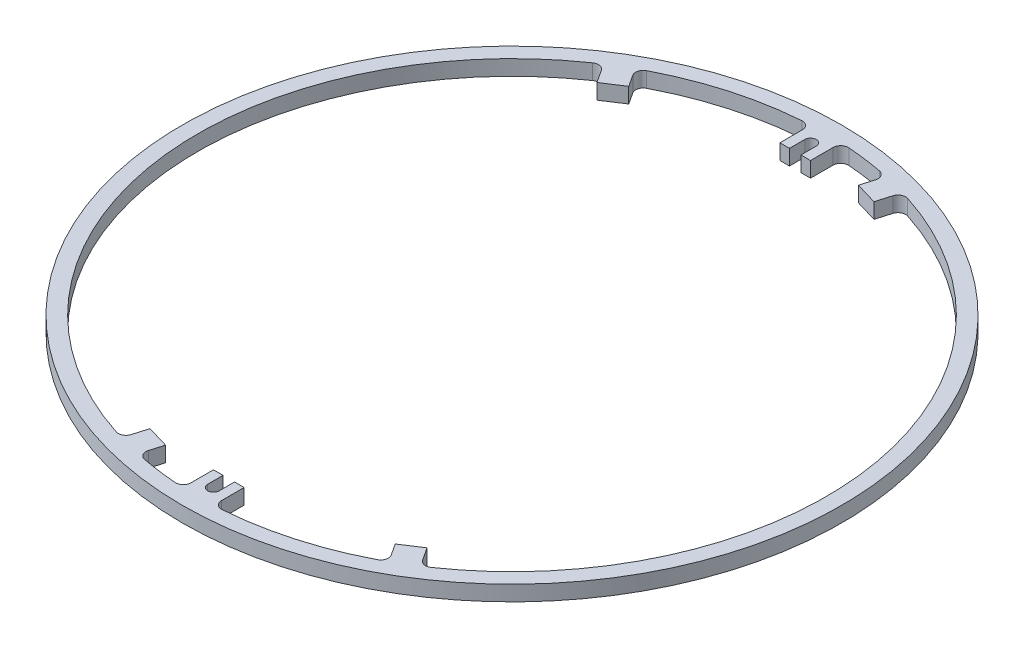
ISO-10303-21;
HEADER;
FILE_DESCRIPTION(('STEP AP214'),'2;1');
FILE_NAME('part.step','',(''),(''),'','','');
FILE_SCHEMA(('AUTOMOTIVE_DESIGN { 1 0 10303 214 1 1 1 1 }'));
ENDSEC;
DATA;
#1=APPLICATION_CONTEXT('core data for automotive mechanical design processes');
#2=APPLICATION_PROTOCOL_DEFINITION('international standard','automotive_design',2000,#1);
#3=PRODUCT_CONTEXT('',#1,'mechanical');
#4=PRODUCT('Part','Part','',(#3));
#5=PRODUCT_RELATED_PRODUCT_CATEGORY('part','',(#4));
#6=PRODUCT_DEFINITION_FORMATION('','',#4);
#7=PRODUCT_DEFINITION_CONTEXT('part definition',#1,'design');
#8=PRODUCT_DEFINITION('design','',#6,#7);
#9=PRODUCT_DEFINITION_SHAPE('','',#8);
#10=(LENGTH_UNIT() NAMED_UNIT(*) SI_UNIT(.MILLI.,.METRE.));
#11=(NAMED_UNIT(*) PLANE_ANGLE_UNIT() SI_UNIT($,.RADIAN.));
#12=(NAMED_UNIT(*) SI_UNIT($,.STERADIAN.) SOLID_ANGLE_UNIT());
#13=UNCERTAINTY_MEASURE_WITH_UNIT(LENGTH_MEASURE(1.E-05),#10,'distance_accuracy_value','');
#14=(GEOMETRIC_REPRESENTATION_CONTEXT(3) GLOBAL_UNCERTAINTY_ASSIGNED_CONTEXT((#13)) GLOBAL_UNIT_ASSIGNED_CONTEXT((#10,
#11,#12)) REPRESENTATION_CONTEXT('',''));
#15=CARTESIAN_POINT('',(0.,0.,0.));
#16=DIRECTION('',(0.,0.,1.));
#17=DIRECTION('',(1.,0.,0.));
#18=AXIS2_PLACEMENT_3D('',#15,#16,#17);
#19=CARTESIAN_POINT('',(0.,2.,0.));
#20=DIRECTION('',(0.,-1.,0.));
#21=DIRECTION('',(0.,0.,-1.));
#22=AXIS2_PLACEMENT_3D('',#19,#20,#21);
#23=CYLINDRICAL_SURFACE('',#22,41.);
#24=CARTESIAN_POINT('',(0.,2.,0.));
#25=DIRECTION('',(0.,1.,0.));
#26=DIRECTION('',(0.,0.,1.));
#27=AXIS2_PLACEMENT_3D('',#24,#25,#26);
#28=CIRCLE('',#27,41.);
#29=CARTESIAN_POINT('',(-3.075,2.,-40.8845248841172));
#30=VERTEX_POINT('',#29);
#31=CARTESIAN_POINT('',(-18.8433014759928,2.,-36.4133215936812));
#32=VERTEX_POINT('',#31);
#33=EDGE_CURVE('E505',#30,#32,#28,.T.);
#34=ORIENTED_EDGE('',*,*,#33,.T.);
#35=DIRECTION('',(0.,-1.,0.));
#36=VECTOR('',#35,1.);
#37=CARTESIAN_POINT('',(-18.8433014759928,2.,-36.4133215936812));
#38=LINE('',#37,#36);
#39=CARTESIAN_POINT('',(-18.8433014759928,0.,-36.4133215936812));
#40=VERTEX_POINT('',#39);
#41=EDGE_CURVE('E611',#32,#40,#38,.T.);
#42=ORIENTED_EDGE('',*,*,#41,.T.);
#43=CARTESIAN_POINT('',(0.,0.,0.));
#44=DIRECTION('',(0.,1.,0.));
#45=DIRECTION('',(0.,0.,1.));
#46=AXIS2_PLACEMENT_3D('',#43,#44,#45);
#47=CIRCLE('',#46,41.);
#48=CARTESIAN_POINT('',(-3.075,0.,-40.8845248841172));
#49=VERTEX_POINT('',#48);
#50=EDGE_CURVE('E510',#49,#40,#47,.T.);
#51=ORIENTED_EDGE('',*,*,#50,.F.);
#52=DIRECTION('',(0.,-1.,0.));
#53=VECTOR('',#52,1.);
#54=CARTESIAN_POINT('',(-3.075,2.,-40.8845248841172));
#55=LINE('',#54,#53);
#56=EDGE_CURVE('E522',#49,#30,#55,.F.);
#57=ORIENTED_EDGE('',*,*,#56,.T.);
#58=EDGE_LOOP('',(#34,#42,#51,#57));
#59=FACE_BOUND('',#58,.T.);
#60=ADVANCED_FACE('F37',(#59),#23,.F.);
#61=CARTESIAN_POINT('',(3.075,2.,40.8845248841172));
#62=VERTEX_POINT('',#61);
#63=CARTESIAN_POINT('',(18.8433014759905,2.,36.4133215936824));
#64=VERTEX_POINT('',#63);
#65=EDGE_CURVE('E500',#62,#64,#28,.T.);
#66=ORIENTED_EDGE('',*,*,#65,.T.);
#67=DIRECTION('',(0.,-1.,0.));
#68=VECTOR('',#67,1.);
#69=CARTESIAN_POINT('',(18.8433014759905,2.,36.4133215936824));
#70=LINE('',#69,#68);
#71=CARTESIAN_POINT('',(18.8433014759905,0.,36.4133215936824));
#72=VERTEX_POINT('',#71);
#73=EDGE_CURVE('E620',#64,#72,#70,.T.);
#74=ORIENTED_EDGE('',*,*,#73,.T.);
#75=CARTESIAN_POINT('',(3.075,0.,40.8845248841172));
#76=VERTEX_POINT('',#75);
#77=EDGE_CURVE('E506',#76,#72,#47,.T.);
#78=ORIENTED_EDGE('',*,*,#77,.F.);
#79=DIRECTION('',(0.,-1.,0.));
#80=VECTOR('',#79,1.);
#81=CARTESIAN_POINT('',(3.075,2.,40.8845248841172));
#82=LINE('',#81,#80);
#83=EDGE_CURVE('E536',#76,#62,#82,.F.);
#84=ORIENTED_EDGE('',*,*,#83,.T.);
#85=EDGE_LOOP('',(#66,#74,#78,#84));
#86=FACE_BOUND('',#85,.T.);
#87=ADVANCED_FACE('F703',(#86),#23,.F.);
#88=CARTESIAN_POINT('',(23.2418440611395,0.,33.7759779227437));
#89=VERTEX_POINT('',#88);
#90=CARTESIAN_POINT('',(12.6237798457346,0.,-39.0082066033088));
#91=VERTEX_POINT('',#90);
#92=EDGE_CURVE('E509',#89,#91,#47,.T.);
#93=ORIENTED_EDGE('',*,*,#92,.F.);
#94=DIRECTION('',(0.,-1.,0.));
#95=VECTOR('',#94,1.);
#96=CARTESIAN_POINT('',(23.2418440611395,2.,33.7759779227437));
#97=LINE('',#96,#95);
#98=CARTESIAN_POINT('',(23.2418440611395,2.,33.7759779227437));
#99=VERTEX_POINT('',#98);
#100=EDGE_CURVE('E618',#89,#99,#97,.F.);
#101=ORIENTED_EDGE('',*,*,#100,.T.);
#102=CARTESIAN_POINT('',(12.6237798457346,2.,-39.0082066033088));
#103=VERTEX_POINT('',#102);
#104=EDGE_CURVE('E504',#99,#103,#28,.T.);
#105=ORIENTED_EDGE('',*,*,#104,.T.);
#106=DIRECTION('',(0.,-1.,0.));
#107=VECTOR('',#106,1.);
#108=CARTESIAN_POINT('',(12.6237798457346,2.,-39.0082066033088));
#109=LINE('',#108,#107);
#110=EDGE_CURVE('E589',#103,#91,#109,.T.);
#111=ORIENTED_EDGE('',*,*,#110,.T.);
#112=EDGE_LOOP('',(#93,#101,#105,#111));
#113=FACE_BOUND('',#112,.T.);
#114=ADVANCED_FACE('F649',(#113),#23,.F.);
#115=CARTESIAN_POINT('',(-23.2418440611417,0.,-33.7759779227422));
#116=VERTEX_POINT('',#115);
#117=CARTESIAN_POINT('',(-12.6237798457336,0.,39.0082066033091));
#118=VERTEX_POINT('',#117);
#119=EDGE_CURVE('E653',#116,#118,#47,.T.);
#120=ORIENTED_EDGE('',*,*,#119,.F.);
#121=DIRECTION('',(0.,-1.,0.));
#122=VECTOR('',#121,1.);
#123=CARTESIAN_POINT('',(-23.2418440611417,2.,-33.7759779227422));
#124=LINE('',#123,#122);
#125=CARTESIAN_POINT('',(-23.2418440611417,2.,-33.7759779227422));
#126=VERTEX_POINT('',#125);
#127=EDGE_CURVE('E609',#116,#126,#124,.F.);
#128=ORIENTED_EDGE('',*,*,#127,.T.);
#129=CARTESIAN_POINT('',(-12.6237798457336,2.,39.0082066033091));
#130=VERTEX_POINT('',#129);
#131=EDGE_CURVE('E755',#126,#130,#28,.T.);
#132=ORIENTED_EDGE('',*,*,#131,.T.);
#133=DIRECTION('',(0.,-1.,0.));
#134=VECTOR('',#133,1.);
#135=CARTESIAN_POINT('',(-12.6237798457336,2.,39.0082066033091));
#136=LINE('',#135,#134);
#137=EDGE_CURVE('E574',#130,#118,#136,.T.);
#138=ORIENTED_EDGE('',*,*,#137,.T.);
#139=EDGE_LOOP('',(#120,#128,#132,#138));
#140=FACE_BOUND('',#139,.T.);
#141=ADVANCED_FACE('F731',(#140),#23,.F.);
#142=CARTESIAN_POINT('',(0.,-5.69147245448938,36.9511904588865));
#143=DIRECTION('',(0.,0.,1.));
#144=DIRECTION('',(1.,0.,0.));
#145=AXIS2_PLACEMENT_3D('',#142,#143,#144);
#146=PLANE('',#145);
#147=DIRECTION('',(1.,0.,0.));
#148=VECTOR('',#147,1.);
#149=CARTESIAN_POINT('',(0.,2.,36.9511904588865));
#150=LINE('',#149,#148);
#151=CARTESIAN_POINT('',(-2.,2.,36.9511904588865));
#152=VERTEX_POINT('',#151);
#153=CARTESIAN_POINT('',(-0.75,2.,36.9511904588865));
#154=VERTEX_POINT('',#153);
#155=EDGE_CURVE('E484',#152,#154,#150,.T.);
#156=ORIENTED_EDGE('',*,*,#155,.T.);
#157=DIRECTION('',(0.,-1.,0.));
#158=VECTOR('',#157,1.);
#159=CARTESIAN_POINT('',(-0.75,-5.69147245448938,36.9511904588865));
#160=LINE('',#159,#158);
#161=CARTESIAN_POINT('',(-0.75,0.,36.9511904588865));
#162=VERTEX_POINT('',#161);
#163=EDGE_CURVE('E563',#154,#162,#160,.T.);
#164=ORIENTED_EDGE('',*,*,#163,.T.);
#165=DIRECTION('',(-1.,0.,0.));
#166=VECTOR('',#165,1.);
#167=CARTESIAN_POINT('',(0.,0.,36.9511904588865));
#168=LINE('',#167,#166);
#169=CARTESIAN_POINT('',(-2.,0.,36.9511904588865));
#170=VERTEX_POINT('',#169);
#171=EDGE_CURVE('E478',#162,#170,#168,.T.);
#172=ORIENTED_EDGE('',*,*,#171,.T.);
#173=DIRECTION('',(0.,1.,0.));
#174=VECTOR('',#173,1.);
#175=CARTESIAN_POINT('',(-2.,-5.69147245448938,36.9511904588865));
#176=LINE('',#175,#174);
#177=EDGE_CURVE('E492',#170,#152,#176,.T.);
#178=ORIENTED_EDGE('',*,*,#177,.T.);
#179=EDGE_LOOP('',(#156,#164,#172,#178));
#180=FACE_BOUND('',#179,.T.);
#181=ADVANCED_FACE('F676',(#180),#146,.F.);
#182=CARTESIAN_POINT('',(0.,-5.69147245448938,-38.9511904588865));
#183=DIRECTION('',(0.,1.,0.));
#184=DIRECTION('',(0.,0.,1.));
#185=AXIS2_PLACEMENT_3D('',#182,#183,#184);
#186=CYLINDRICAL_SURFACE('',#185,0.750000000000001);
#187=DIRECTION('',(0.,1.,0.));
#188=VECTOR('',#187,1.);
#189=CARTESIAN_POINT('',(0.75,0.,-38.9511904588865));
#190=LINE('',#189,#188);
#191=CARTESIAN_POINT('',(0.75,0.,-38.9511904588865));
#192=VERTEX_POINT('',#191);
#193=CARTESIAN_POINT('',(0.75,2.,-38.9511904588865));
#194=VERTEX_POINT('',#193);
#195=EDGE_CURVE('E420',#192,#194,#190,.T.);
#196=ORIENTED_EDGE('',*,*,#195,.T.);
#197=CARTESIAN_POINT('',(0.,2.,-38.9511904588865));
#198=DIRECTION('',(0.,1.,0.));
#199=DIRECTION('',(0.,0.,1.));
#200=AXIS2_PLACEMENT_3D('',#197,#198,#199);
#201=CIRCLE('',#200,0.750000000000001);
#202=CARTESIAN_POINT('',(-0.75,2.,-38.9511904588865));
#203=VERTEX_POINT('',#202);
#204=EDGE_CURVE('E423',#194,#203,#201,.T.);
#205=ORIENTED_EDGE('',*,*,#204,.T.);
#206=DIRECTION('',(0.,1.,0.));
#207=VECTOR('',#206,1.);
#208=CARTESIAN_POINT('',(-0.75,0.,-38.9511904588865));
#209=LINE('',#208,#207);
#210=CARTESIAN_POINT('',(-0.75,0.,-38.9511904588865));
#211=VERTEX_POINT('',#210);
#212=EDGE_CURVE('E415',#211,#203,#209,.T.);
#213=ORIENTED_EDGE('',*,*,#212,.F.);
#214=CARTESIAN_POINT('',(0.,0.,-38.9511904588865));
#215=DIRECTION('',(0.,1.,0.));
#216=DIRECTION('',(0.,0.,1.));
#217=AXIS2_PLACEMENT_3D('',#214,#215,#216);
#218=CIRCLE('',#217,0.750000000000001);
#219=EDGE_CURVE('E455',#211,#192,#218,.F.);
#220=ORIENTED_EDGE('',*,*,#219,.T.);
#221=EDGE_LOOP('',(#196,#205,#213,#220));
#222=FACE_BOUND('',#221,.T.);
#223=ADVANCED_FACE('F735',(#222),#186,.F.);
#224=CARTESIAN_POINT('',(0.,-5.69147245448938,-36.9511904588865));
#225=DIRECTION('',(0.,0.,1.));
#226=DIRECTION('',(1.,0.,0.));
#227=AXIS2_PLACEMENT_3D('',#224,#225,#226);
#228=PLANE('',#227);
#229=DIRECTION('',(0.,1.,0.));
#230=VECTOR('',#229,1.);
#231=CARTESIAN_POINT('',(0.75,-5.69147245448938,-36.9511904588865));
#232=LINE('',#231,#230);
#233=CARTESIAN_POINT('',(0.75,0.,-36.9511904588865));
#234=VERTEX_POINT('',#233);
#235=CARTESIAN_POINT('',(0.75,2.,-36.9511904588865));
#236=VERTEX_POINT('',#235);
#237=EDGE_CURVE('E558',#234,#236,#232,.T.);
#238=ORIENTED_EDGE('',*,*,#237,.F.);
#239=DIRECTION('',(-1.,0.,0.));
#240=VECTOR('',#239,1.);
#241=CARTESIAN_POINT('',(0.,0.,-36.9511904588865));
#242=LINE('',#241,#240);
#243=CARTESIAN_POINT('',(2.,0.,-36.9511904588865));
#244=VERTEX_POINT('',#243);
#245=EDGE_CURVE('E449',#244,#234,#242,.T.);
#246=ORIENTED_EDGE('',*,*,#245,.F.);
#247=DIRECTION('',(0.,1.,0.));
#248=VECTOR('',#247,1.);
#249=CARTESIAN_POINT('',(2.,-5.69147245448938,-36.9511904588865));
#250=LINE('',#249,#248);
#251=CARTESIAN_POINT('',(2.,2.,-36.9511904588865));
#252=VERTEX_POINT('',#251);
#253=EDGE_CURVE('E448',#244,#252,#250,.T.);
#254=ORIENTED_EDGE('',*,*,#253,.T.);
#255=DIRECTION('',(1.,0.,0.));
#256=VECTOR('',#255,1.);
#257=CARTESIAN_POINT('',(0.,2.,-36.9511904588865));
#258=LINE('',#257,#256);
#259=EDGE_CURVE('E466',#236,#252,#258,.T.);
#260=ORIENTED_EDGE('',*,*,#259,.F.);
#261=EDGE_LOOP('',(#238,#246,#254,#260));
#262=FACE_BOUND('',#261,.T.);
#263=ADVANCED_FACE('F729',(#262),#228,.T.);
#264=CARTESIAN_POINT('',(7.65509878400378,0.,-40.2790201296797));
#265=VERTEX_POINT('',#264);
#266=CARTESIAN_POINT('',(3.075,0.,-40.8845248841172));
#267=VERTEX_POINT('',#266);
#268=EDGE_CURVE('E652',#265,#267,#47,.T.);
#269=ORIENTED_EDGE('',*,*,#268,.F.);
#270=DIRECTION('',(0.,-1.,0.));
#271=VECTOR('',#270,1.);
#272=CARTESIAN_POINT('',(7.65509878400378,2.,-40.2790201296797));
#273=LINE('',#272,#271);
#274=CARTESIAN_POINT('',(7.65509878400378,2.,-40.2790201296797));
#275=VERTEX_POINT('',#274);
#276=EDGE_CURVE('E592',#265,#275,#273,.F.);
#277=ORIENTED_EDGE('',*,*,#276,.T.);
#278=CARTESIAN_POINT('',(3.075,2.,-40.8845248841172));
#279=VERTEX_POINT('',#278);
#280=EDGE_CURVE('E770',#275,#279,#28,.T.);
#281=ORIENTED_EDGE('',*,*,#280,.T.);
#282=DIRECTION('',(0.,-1.,0.));
#283=VECTOR('',#282,1.);
#284=CARTESIAN_POINT('',(3.075,2.,-40.8845248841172));
#285=LINE('',#284,#283);
#286=EDGE_CURVE('E519',#279,#267,#285,.T.);
#287=ORIENTED_EDGE('',*,*,#286,.T.);
#288=EDGE_LOOP('',(#269,#277,#281,#287));
#289=FACE_BOUND('',#288,.T.);
#290=ADVANCED_FACE('F723',(#289),#23,.F.);
#291=CARTESIAN_POINT('',(-7.65509878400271,0.,40.2790201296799));
#292=VERTEX_POINT('',#291);
#293=CARTESIAN_POINT('',(-3.075,0.,40.8845248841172));
#294=VERTEX_POINT('',#293);
#295=EDGE_CURVE('E483',#292,#294,#47,.T.);
#296=ORIENTED_EDGE('',*,*,#295,.F.);
#297=DIRECTION('',(0.,-1.,0.));
#298=VECTOR('',#297,1.);
#299=CARTESIAN_POINT('',(-7.65509878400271,2.,40.2790201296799));
#300=LINE('',#299,#298);
#301=CARTESIAN_POINT('',(-7.65509878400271,2.,40.2790201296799));
#302=VERTEX_POINT('',#301);
#303=EDGE_CURVE('E566',#292,#302,#300,.F.);
#304=ORIENTED_EDGE('',*,*,#303,.T.);
#305=CARTESIAN_POINT('',(-3.075,2.,40.8845248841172));
#306=VERTEX_POINT('',#305);
#307=EDGE_CURVE('E508',#302,#306,#28,.T.);
#308=ORIENTED_EDGE('',*,*,#307,.T.);
#309=DIRECTION('',(0.,-1.,0.));
#310=VECTOR('',#309,1.);
#311=CARTESIAN_POINT('',(-3.075,2.,40.8845248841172));
#312=LINE('',#311,#310);
#313=EDGE_CURVE('E544',#306,#294,#312,.T.);
#314=ORIENTED_EDGE('',*,*,#313,.T.);
#315=EDGE_LOOP('',(#296,#304,#308,#314));
#316=FACE_BOUND('',#315,.T.);
#317=ADVANCED_FACE('F663',(#316),#23,.F.);
#318=CARTESIAN_POINT('',(0.,2.,0.));
#319=DIRECTION('',(0.,1.,0.));
#320=DIRECTION('',(0.,0.,1.));
#321=AXIS2_PLACEMENT_3D('',#318,#319,#320);
#322=PLANE('',#321);
#323=DIRECTION('',(0.,0.,-1.));
#324=VECTOR('',#323,1.);
#325=CARTESIAN_POINT('',(0.75,2.,-35.9511904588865));
#326=LINE('',#325,#324);
#327=EDGE_CURVE('E412',#236,#194,#326,.T.);
#328=ORIENTED_EDGE('',*,*,#327,.F.);
#329=ORIENTED_EDGE('',*,*,#259,.T.);
#330=DIRECTION('',(0.,0.,1.));
#331=VECTOR('',#330,1.);
#332=CARTESIAN_POINT('',(1.99999999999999,2.,0.));
#333=LINE('',#332,#331);
#334=CARTESIAN_POINT('',(2.,2.,-39.8873413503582));
#335=VERTEX_POINT('',#334);
#336=EDGE_CURVE('E461',#335,#252,#333,.T.);
#337=ORIENTED_EDGE('',*,*,#336,.F.);
#338=CARTESIAN_POINT('',(3.,2.,-39.8873413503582));
#339=DIRECTION('',(0.,1.,0.));
#340=DIRECTION('',(0.,0.,1.));
#341=AXIS2_PLACEMENT_3D('',#338,#339,#340);
#342=CIRCLE('',#341,1.);
#343=EDGE_CURVE('E527',#335,#279,#342,.F.);
#344=ORIENTED_EDGE('',*,*,#343,.T.);
#345=ORIENTED_EDGE('',*,*,#280,.F.);
#346=CARTESIAN_POINT('',(7.46838905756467,2.,-39.2966050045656));
#347=DIRECTION('',(0.,1.,0.));
#348=DIRECTION('',(0.,0.,1.));
#349=AXIS2_PLACEMENT_3D('',#346,#347,#348);
#350=CIRCLE('',#349,1.);
#351=CARTESIAN_POINT('',(8.42720879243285,2.,-39.0125896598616));
#352=VERTEX_POINT('',#351);
#353=EDGE_CURVE('E602',#275,#352,#350,.F.);
#354=ORIENTED_EDGE('',*,*,#353,.T.);
#355=DIRECTION('',(-0.284015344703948,0.,0.958819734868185));
#356=VECTOR('',#355,1.);
#357=CARTESIAN_POINT('',(7.9161238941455,2.,-37.2871959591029));
#358=LINE('',#357,#356);
#359=CARTESIAN_POINT('',(7.9161238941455,2.,-37.2871959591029));
#360=VERTEX_POINT('',#359);
#361=EDGE_CURVE('E360',#352,#360,#358,.T.);
#362=ORIENTED_EDGE('',*,*,#361,.T.);
#363=DIRECTION('',(0.958819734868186,0.,0.284015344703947));
#364=VECTOR('',#363,1.);
#365=CARTESIAN_POINT('',(10.79258309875,2.,-36.435149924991));
#366=LINE('',#365,#364);
#367=CARTESIAN_POINT('',(10.79258309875,2.,-36.435149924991));
#368=VERTEX_POINT('',#367);
#369=EDGE_CURVE('E375',#360,#368,#366,.T.);
#370=ORIENTED_EDGE('',*,*,#369,.T.);
#371=DIRECTION('',(0.284015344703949,0.,-0.958819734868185));
#372=VECTOR('',#371,1.);
#373=CARTESIAN_POINT('',(11.6446291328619,2.,-39.3116091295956));
#374=LINE('',#373,#372);
#375=CARTESIAN_POINT('',(11.3570630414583,2.,-38.3408022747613));
#376=VERTEX_POINT('',#375);
#377=EDGE_CURVE('E378',#368,#376,#374,.T.);
#378=ORIENTED_EDGE('',*,*,#377,.T.);
#379=CARTESIAN_POINT('',(12.3158827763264,2.,-38.0567869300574));
#380=DIRECTION('',(0.,1.,0.));
#381=DIRECTION('',(0.,0.,1.));
#382=AXIS2_PLACEMENT_3D('',#379,#380,#381);
#383=CIRCLE('',#382,1.);
#384=EDGE_CURVE('E597',#376,#103,#383,.F.);
#385=ORIENTED_EDGE('',*,*,#384,.T.);
#386=ORIENTED_EDGE('',*,*,#104,.F.);
#387=CARTESIAN_POINT('',(22.6749698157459,2.,32.9521735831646));
#388=DIRECTION('',(0.,1.,0.));
#389=DIRECTION('',(0.,0.,1.));
#390=AXIS2_PLACEMENT_3D('',#387,#388,#389);
#391=CIRCLE('',#390,1.);
#392=CARTESIAN_POINT('',(21.8372510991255,2.,33.498275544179));
#393=VERTEX_POINT('',#392);
#394=EDGE_CURVE('E634',#99,#393,#391,.F.);
#395=ORIENTED_EDGE('',*,*,#394,.T.);
#396=DIRECTION('',(0.546101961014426,0.,0.837718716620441));
#397=VECTOR('',#396,1.);
#398=CARTESIAN_POINT('',(22.3901804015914,2.,34.3464673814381));
#399=LINE('',#398,#397);
#400=CARTESIAN_POINT('',(20.7518745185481,2.,31.8333112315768));
#401=VERTEX_POINT('',#400);
#402=EDGE_CURVE('E357',#401,#393,#399,.T.);
#403=ORIENTED_EDGE('',*,*,#402,.F.);
#404=DIRECTION('',(0.837718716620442,0.,-0.546101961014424));
#405=VECTOR('',#404,1.);
#406=CARTESIAN_POINT('',(20.7518745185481,2.,31.8333112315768));
#407=LINE('',#406,#405);
#408=CARTESIAN_POINT('',(18.2387183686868,2.,33.4716171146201));
#409=VERTEX_POINT('',#408);
#410=EDGE_CURVE('E362',#409,#401,#407,.T.);
#411=ORIENTED_EDGE('',*,*,#410,.F.);
#412=DIRECTION('',(-0.546101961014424,0.,-0.837718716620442));
#413=VECTOR('',#412,1.);
#414=CARTESIAN_POINT('',(18.2387183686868,2.,33.4716171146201));
#415=LINE('',#414,#413);
#416=CARTESIAN_POINT('',(19.2214274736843,2.,34.9790898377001));
#417=VERTEX_POINT('',#416);
#418=EDGE_CURVE('E349',#417,#409,#415,.T.);
#419=ORIENTED_EDGE('',*,*,#418,.F.);
#420=CARTESIAN_POINT('',(18.3837087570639,2.,35.5251917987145));
#421=DIRECTION('',(0.,1.,0.));
#422=DIRECTION('',(0.,0.,1.));
#423=AXIS2_PLACEMENT_3D('',#420,#421,#422);
#424=CIRCLE('',#423,1.);
#425=EDGE_CURVE('E11',#417,#64,#424,.F.);
#426=ORIENTED_EDGE('',*,*,#425,.T.);
#427=ORIENTED_EDGE('',*,*,#65,.F.);
#428=CARTESIAN_POINT('',(3.,2.,39.8873413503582));
#429=DIRECTION('',(0.,1.,0.));
#430=DIRECTION('',(0.,0.,1.));
#431=AXIS2_PLACEMENT_3D('',#428,#429,#430);
#432=CIRCLE('',#431,1.);
#433=CARTESIAN_POINT('',(2.,2.,39.8873413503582));
#434=VERTEX_POINT('',#433);
#435=EDGE_CURVE('E547',#62,#434,#432,.F.);
#436=ORIENTED_EDGE('',*,*,#435,.T.);
#437=DIRECTION('',(0.,0.,-1.));
#438=VECTOR('',#437,1.);
#439=CARTESIAN_POINT('',(1.99999999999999,2.,0.));
#440=LINE('',#439,#438);
#441=CARTESIAN_POINT('',(2.,2.,36.9511904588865));
#442=VERTEX_POINT('',#441);
#443=EDGE_CURVE('E489',#434,#442,#440,.T.);
#444=ORIENTED_EDGE('',*,*,#443,.T.);
#445=CARTESIAN_POINT('',(0.75,2.,36.9511904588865));
#446=VERTEX_POINT('',#445);
#447=EDGE_CURVE('E458',#446,#442,#150,.T.);
#448=ORIENTED_EDGE('',*,*,#447,.F.);
#449=DIRECTION('',(0.,0.,-1.));
#450=VECTOR('',#449,1.);
#451=CARTESIAN_POINT('',(0.75,2.,35.9511904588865));
#452=LINE('',#451,#450);
#453=CARTESIAN_POINT('',(0.75,2.,38.9511904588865));
#454=VERTEX_POINT('',#453);
#455=EDGE_CURVE('E438',#454,#446,#452,.T.);
#456=ORIENTED_EDGE('',*,*,#455,.F.);
#457=CARTESIAN_POINT('',(0.,2.,38.9511904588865));
#458=DIRECTION('',(0.,1.,0.));
#459=DIRECTION('',(0.,0.,-1.));
#460=AXIS2_PLACEMENT_3D('',#457,#458,#459);
#461=CIRCLE('',#460,0.75);
#462=CARTESIAN_POINT('',(-0.75,2.,38.9511904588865));
#463=VERTEX_POINT('',#462);
#464=EDGE_CURVE('E407',#463,#454,#461,.T.);
#465=ORIENTED_EDGE('',*,*,#464,.F.);
#466=DIRECTION('',(0.,0.,1.));
#467=VECTOR('',#466,1.);
#468=CARTESIAN_POINT('',(-0.75,2.,38.9511904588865));
#469=LINE('',#468,#467);
#470=EDGE_CURVE('E429',#154,#463,#469,.T.);
#471=ORIENTED_EDGE('',*,*,#470,.F.);
#472=ORIENTED_EDGE('',*,*,#155,.F.);
#473=DIRECTION('',(0.,0.,-1.));
#474=VECTOR('',#473,1.);
#475=CARTESIAN_POINT('',(-1.99999999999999,2.,0.));
#476=LINE('',#475,#474);
#477=CARTESIAN_POINT('',(-2.,2.,39.8873413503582));
#478=VERTEX_POINT('',#477);
#479=EDGE_CURVE('E487',#478,#152,#476,.T.);
#480=ORIENTED_EDGE('',*,*,#479,.F.);
#481=CARTESIAN_POINT('',(-3.,2.,39.8873413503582));
#482=DIRECTION('',(0.,1.,0.));
#483=DIRECTION('',(0.,0.,1.));
#484=AXIS2_PLACEMENT_3D('',#481,#482,#483);
#485=CIRCLE('',#484,1.);
#486=EDGE_CURVE('E551',#478,#306,#485,.F.);
#487=ORIENTED_EDGE('',*,*,#486,.T.);
#488=ORIENTED_EDGE('',*,*,#307,.F.);
#489=CARTESIAN_POINT('',(-7.46838905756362,2.,39.2966050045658));
#490=DIRECTION('',(0.,1.,0.));
#491=DIRECTION('',(0.,0.,1.));
#492=AXIS2_PLACEMENT_3D('',#489,#490,#491);
#493=CIRCLE('',#492,1.);
#494=CARTESIAN_POINT('',(-8.4272087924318,2.,39.0125896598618));
#495=VERTEX_POINT('',#494);
#496=EDGE_CURVE('E577',#302,#495,#493,.F.);
#497=ORIENTED_EDGE('',*,*,#496,.T.);
#498=DIRECTION('',(0.284015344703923,0.,-0.958819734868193));
#499=VECTOR('',#498,1.);
#500=CARTESIAN_POINT('',(-7.9161238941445,2.,37.2871959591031));
#501=LINE('',#500,#499);
#502=CARTESIAN_POINT('',(-7.9161238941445,2.,37.2871959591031));
#503=VERTEX_POINT('',#502);
#504=EDGE_CURVE('E387',#495,#503,#501,.T.);
#505=ORIENTED_EDGE('',*,*,#504,.T.);
#506=DIRECTION('',(-0.958819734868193,0.,-0.284015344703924));
#507=VECTOR('',#506,1.);
#508=CARTESIAN_POINT('',(-10.7925830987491,2.,36.4351499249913));
#509=LINE('',#508,#507);
#510=CARTESIAN_POINT('',(-10.7925830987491,2.,36.4351499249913));
#511=VERTEX_POINT('',#510);
#512=EDGE_CURVE('E395',#503,#511,#509,.T.);
#513=ORIENTED_EDGE('',*,*,#512,.T.);
#514=DIRECTION('',(-0.284015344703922,0.,0.958819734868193));
#515=VECTOR('',#514,1.);
#516=CARTESIAN_POINT('',(-11.6446291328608,2.,39.3116091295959));
#517=LINE('',#516,#515);
#518=CARTESIAN_POINT('',(-11.3570630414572,2.,38.3408022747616));
#519=VERTEX_POINT('',#518);
#520=EDGE_CURVE('E398',#511,#519,#517,.T.);
#521=ORIENTED_EDGE('',*,*,#520,.T.);
#522=CARTESIAN_POINT('',(-12.3158827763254,2.,38.0567869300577));
#523=DIRECTION('',(0.,1.,0.));
#524=DIRECTION('',(0.,0.,1.));
#525=AXIS2_PLACEMENT_3D('',#522,#523,#524);
#526=CIRCLE('',#525,1.);
#527=EDGE_CURVE('E581',#519,#130,#526,.F.);
#528=ORIENTED_EDGE('',*,*,#527,.T.);
#529=ORIENTED_EDGE('',*,*,#131,.F.);
#530=CARTESIAN_POINT('',(-22.674969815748,2.,-32.9521735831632));
#531=DIRECTION('',(0.,1.,0.));
#532=DIRECTION('',(0.,0.,1.));
#533=AXIS2_PLACEMENT_3D('',#530,#531,#532);
#534=CIRCLE('',#533,1.);
#535=CARTESIAN_POINT('',(-21.8372510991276,2.,-33.4982755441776));
#536=VERTEX_POINT('',#535);
#537=EDGE_CURVE('E626',#126,#536,#534,.F.);
#538=ORIENTED_EDGE('',*,*,#537,.T.);
#539=DIRECTION('',(-0.546101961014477,0.,-0.837718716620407));
#540=VECTOR('',#539,1.);
#541=CARTESIAN_POINT('',(-22.3901804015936,2.,-34.3464673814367));
#542=LINE('',#541,#540);
#543=CARTESIAN_POINT('',(-20.7518745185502,2.,-31.8333112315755));
#544=VERTEX_POINT('',#543);
#545=EDGE_CURVE('E335',#544,#536,#542,.T.);
#546=ORIENTED_EDGE('',*,*,#545,.F.);
#547=DIRECTION('',(-0.837718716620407,0.,0.546101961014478));
#548=VECTOR('',#547,1.);
#549=CARTESIAN_POINT('',(-20.7518745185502,2.,-31.8333112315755));
#550=LINE('',#549,#548);
#551=CARTESIAN_POINT('',(-18.2387183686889,2.,-33.4716171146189));
#552=VERTEX_POINT('',#551);
#553=EDGE_CURVE('E330',#552,#544,#550,.T.);
#554=ORIENTED_EDGE('',*,*,#553,.F.);
#555=DIRECTION('',(0.546101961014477,0.,0.837718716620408));
#556=VECTOR('',#555,1.);
#557=CARTESIAN_POINT('',(-18.2387183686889,2.,-33.4716171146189));
#558=LINE('',#557,#556);
#559=CARTESIAN_POINT('',(-19.2214274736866,2.,-34.9790898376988));
#560=VERTEX_POINT('',#559);
#561=EDGE_CURVE('E316',#560,#552,#558,.T.);
#562=ORIENTED_EDGE('',*,*,#561,.F.);
#563=CARTESIAN_POINT('',(-18.3837087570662,2.,-35.5251917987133));
#564=DIRECTION('',(0.,1.,0.));
#565=DIRECTION('',(0.,0.,1.));
#566=AXIS2_PLACEMENT_3D('',#563,#564,#565);
#567=CIRCLE('',#566,1.);
#568=EDGE_CURVE('E630',#560,#32,#567,.F.);
#569=ORIENTED_EDGE('',*,*,#568,.T.);
#570=ORIENTED_EDGE('',*,*,#33,.F.);
#571=CARTESIAN_POINT('',(-3.,2.,-39.8873413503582));
#572=DIRECTION('',(0.,1.,0.));
#573=DIRECTION('',(0.,0.,1.));
#574=AXIS2_PLACEMENT_3D('',#571,#572,#573);
#575=CIRCLE('',#574,1.);
#576=CARTESIAN_POINT('',(-2.,2.,-39.8873413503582));
#577=VERTEX_POINT('',#576);
#578=EDGE_CURVE('E532',#30,#577,#575,.F.);
#579=ORIENTED_EDGE('',*,*,#578,.T.);
#580=DIRECTION('',(0.,0.,1.));
#581=VECTOR('',#580,1.);
#582=CARTESIAN_POINT('',(-1.99999999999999,2.,0.));
#583=LINE('',#582,#581);
#584=CARTESIAN_POINT('',(-2.,2.,-36.9511904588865));
#585=VERTEX_POINT('',#584);
#586=EDGE_CURVE('E464',#577,#585,#583,.T.);
#587=ORIENTED_EDGE('',*,*,#586,.T.);
#588=CARTESIAN_POINT('',(-0.75,2.,-36.9511904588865));
#589=VERTEX_POINT('',#588);
#590=EDGE_CURVE('E467',#585,#589,#258,.T.);
#591=ORIENTED_EDGE('',*,*,#590,.T.);
#592=DIRECTION('',(0.,0.,1.));
#593=VECTOR('',#592,1.);
#594=CARTESIAN_POINT('',(-0.75,2.,-38.9511904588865));
#595=LINE('',#594,#593);
#596=EDGE_CURVE('E416',#203,#589,#595,.T.);
#597=ORIENTED_EDGE('',*,*,#596,.F.);
#598=ORIENTED_EDGE('',*,*,#204,.F.);
#599=EDGE_LOOP('',(#328,#329,#337,#344,#345,#354,#362,#370,#378,#385,#386,#395,#403,#411,#419,
#426,#427,#436,#444,#448,#456,#465,#471,#472,#480,#487,#488,#497,#505,#513,#521,#528,#529,#538,
#546,#554,#562,#569,#570,#579,#587,#591,#597,#598));
#600=FACE_BOUND('',#599,.T.);
#601=CARTESIAN_POINT('',(0.,2.,0.));
#602=DIRECTION('',(0.,1.,0.));
#603=DIRECTION('',(0.,0.,1.));
#604=AXIS2_PLACEMENT_3D('',#601,#602,#603);
#605=CIRCLE('',#604,43.);
#606=CARTESIAN_POINT('',(0.,2.,43.));
#607=VERTEX_POINT('',#606);
#608=EDGE_CURVE('E511',#607,#607,#605,.T.);
#609=ORIENTED_EDGE('',*,*,#608,.T.);
#610=EDGE_LOOP('',(#609));
#611=FACE_BOUND('',#610,.T.);
#612=ADVANCED_FACE('F332',(#600,#611),#322,.T.);
#613=CARTESIAN_POINT('',(0.,0.,0.));
#614=DIRECTION('',(0.,1.,0.));
#615=DIRECTION('',(0.,0.,1.));
#616=AXIS2_PLACEMENT_3D('',#613,#614,#615);
#617=PLANE('',#616);
#618=CARTESIAN_POINT('',(0.,0.,0.));
#619=DIRECTION('',(0.,1.,0.));
#620=DIRECTION('',(0.,0.,1.));
#621=AXIS2_PLACEMENT_3D('',#618,#619,#620);
#622=CIRCLE('',#621,43.);
#623=CARTESIAN_POINT('',(0.,0.,43.));
#624=VERTEX_POINT('',#623);
#625=EDGE_CURVE('E503',#624,#624,#622,.T.);
#626=ORIENTED_EDGE('',*,*,#625,.F.);
#627=EDGE_LOOP('',(#626));
#628=FACE_BOUND('',#627,.T.);
#629=ORIENTED_EDGE('',*,*,#245,.T.);
#630=DIRECTION('',(0.,0.,-1.));
#631=VECTOR('',#630,1.);
#632=CARTESIAN_POINT('',(0.75,0.,-35.9511904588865));
#633=LINE('',#632,#631);
#634=EDGE_CURVE('E411',#234,#192,#633,.T.);
#635=ORIENTED_EDGE('',*,*,#634,.T.);
#636=ORIENTED_EDGE('',*,*,#219,.F.);
#637=DIRECTION('',(0.,0.,1.));
#638=VECTOR('',#637,1.);
#639=CARTESIAN_POINT('',(-0.75,0.,-38.9511904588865));
#640=LINE('',#639,#638);
#641=CARTESIAN_POINT('',(-0.75,0.,-36.9511904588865));
#642=VERTEX_POINT('',#641);
#643=EDGE_CURVE('E408',#211,#642,#640,.T.);
#644=ORIENTED_EDGE('',*,*,#643,.T.);
#645=CARTESIAN_POINT('',(-2.,0.,-36.9511904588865));
#646=VERTEX_POINT('',#645);
#647=EDGE_CURVE('E447',#642,#646,#242,.T.);
#648=ORIENTED_EDGE('',*,*,#647,.T.);
#649=DIRECTION('',(0.,0.,-1.));
#650=VECTOR('',#649,1.);
#651=CARTESIAN_POINT('',(-1.99999999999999,0.,0.));
#652=LINE('',#651,#650);
#653=CARTESIAN_POINT('',(-2.,0.,-39.8873413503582));
#654=VERTEX_POINT('',#653);
#655=EDGE_CURVE('E444',#646,#654,#652,.T.);
#656=ORIENTED_EDGE('',*,*,#655,.T.);
#657=CARTESIAN_POINT('',(-3.,0.,-39.8873413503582));
#658=DIRECTION('',(0.,1.,0.));
#659=DIRECTION('',(0.,0.,1.));
#660=AXIS2_PLACEMENT_3D('',#657,#658,#659);
#661=CIRCLE('',#660,1.);
#662=EDGE_CURVE('E534',#654,#49,#661,.T.);
#663=ORIENTED_EDGE('',*,*,#662,.T.);
#664=ORIENTED_EDGE('',*,*,#50,.T.);
#665=CARTESIAN_POINT('',(-18.3837087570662,0.,-35.5251917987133));
#666=DIRECTION('',(0.,1.,0.));
#667=DIRECTION('',(0.,0.,1.));
#668=AXIS2_PLACEMENT_3D('',#665,#666,#667);
#669=CIRCLE('',#668,1.);
#670=CARTESIAN_POINT('',(-19.2214274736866,0.,-34.9790898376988));
#671=VERTEX_POINT('',#670);
#672=EDGE_CURVE('E628',#40,#671,#669,.T.);
#673=ORIENTED_EDGE('',*,*,#672,.T.);
#674=DIRECTION('',(0.546101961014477,0.,0.837718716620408));
#675=VECTOR('',#674,1.);
#676=CARTESIAN_POINT('',(-18.2387183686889,0.,-33.4716171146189));
#677=LINE('',#676,#675);
#678=CARTESIAN_POINT('',(-18.2387183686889,0.,-33.4716171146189));
#679=VERTEX_POINT('',#678);
#680=EDGE_CURVE('E762',#671,#679,#677,.T.);
#681=ORIENTED_EDGE('',*,*,#680,.T.);
#682=DIRECTION('',(-0.837718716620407,0.,0.546101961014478));
#683=VECTOR('',#682,1.);
#684=CARTESIAN_POINT('',(-20.7518745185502,0.,-31.8333112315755));
#685=LINE('',#684,#683);
#686=CARTESIAN_POINT('',(-20.7518745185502,0.,-31.8333112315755));
#687=VERTEX_POINT('',#686);
#688=EDGE_CURVE('E342',#679,#687,#685,.T.);
#689=ORIENTED_EDGE('',*,*,#688,.T.);
#690=DIRECTION('',(-0.546101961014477,0.,-0.837718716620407));
#691=VECTOR('',#690,1.);
#692=CARTESIAN_POINT('',(-22.3901804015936,0.,-34.3464673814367));
#693=LINE('',#692,#691);
#694=CARTESIAN_POINT('',(-21.8372510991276,0.,-33.4982755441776));
#695=VERTEX_POINT('',#694);
#696=EDGE_CURVE('E327',#687,#695,#693,.T.);
#697=ORIENTED_EDGE('',*,*,#696,.T.);
#698=CARTESIAN_POINT('',(-22.674969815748,0.,-32.9521735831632));
#699=DIRECTION('',(0.,1.,0.));
#700=DIRECTION('',(0.,0.,1.));
#701=AXIS2_PLACEMENT_3D('',#698,#699,#700);
#702=CIRCLE('',#701,1.);
#703=EDGE_CURVE('E624',#695,#116,#702,.T.);
#704=ORIENTED_EDGE('',*,*,#703,.T.);
#705=ORIENTED_EDGE('',*,*,#119,.T.);
#706=CARTESIAN_POINT('',(-12.3158827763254,0.,38.0567869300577));
#707=DIRECTION('',(0.,1.,0.));
#708=DIRECTION('',(0.,0.,1.));
#709=AXIS2_PLACEMENT_3D('',#706,#707,#708);
#710=CIRCLE('',#709,1.);
#711=CARTESIAN_POINT('',(-11.3570630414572,0.,38.3408022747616));
#712=VERTEX_POINT('',#711);
#713=EDGE_CURVE('E584',#118,#712,#710,.T.);
#714=ORIENTED_EDGE('',*,*,#713,.T.);
#715=DIRECTION('',(0.284015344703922,0.,-0.958819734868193));
#716=VECTOR('',#715,1.);
#717=CARTESIAN_POINT('',(-11.6446291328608,0.,39.3116091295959));
#718=LINE('',#717,#716);
#719=CARTESIAN_POINT('',(-10.7925830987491,0.,36.4351499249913));
#720=VERTEX_POINT('',#719);
#721=EDGE_CURVE('E390',#712,#720,#718,.T.);
#722=ORIENTED_EDGE('',*,*,#721,.T.);
#723=DIRECTION('',(0.958819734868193,0.,0.284015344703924));
#724=VECTOR('',#723,1.);
#725=CARTESIAN_POINT('',(-10.7925830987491,0.,36.4351499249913));
#726=LINE('',#725,#724);
#727=CARTESIAN_POINT('',(-7.9161238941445,0.,37.2871959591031));
#728=VERTEX_POINT('',#727);
#729=EDGE_CURVE('E388',#720,#728,#726,.T.);
#730=ORIENTED_EDGE('',*,*,#729,.T.);
#731=DIRECTION('',(-0.284015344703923,0.,0.958819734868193));
#732=VECTOR('',#731,1.);
#733=CARTESIAN_POINT('',(-7.9161238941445,0.,37.2871959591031));
#734=LINE('',#733,#732);
#735=CARTESIAN_POINT('',(-8.4272087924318,0.,39.0125896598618));
#736=VERTEX_POINT('',#735);
#737=EDGE_CURVE('E393',#728,#736,#734,.T.);
#738=ORIENTED_EDGE('',*,*,#737,.T.);
#739=CARTESIAN_POINT('',(-7.46838905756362,0.,39.2966050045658));
#740=DIRECTION('',(0.,1.,0.));
#741=DIRECTION('',(0.,0.,1.));
#742=AXIS2_PLACEMENT_3D('',#739,#740,#741);
#743=CIRCLE('',#742,1.);
#744=EDGE_CURVE('E579',#736,#292,#743,.T.);
#745=ORIENTED_EDGE('',*,*,#744,.T.);
#746=ORIENTED_EDGE('',*,*,#295,.T.);
#747=CARTESIAN_POINT('',(-3.,0.,39.8873413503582));
#748=DIRECTION('',(0.,1.,0.));
#749=DIRECTION('',(0.,0.,1.));
#750=AXIS2_PLACEMENT_3D('',#747,#748,#749);
#751=CIRCLE('',#750,1.);
#752=CARTESIAN_POINT('',(-2.,0.,39.8873413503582));
#753=VERTEX_POINT('',#752);
#754=EDGE_CURVE('E554',#294,#753,#751,.T.);
#755=ORIENTED_EDGE('',*,*,#754,.T.);
#756=DIRECTION('',(0.,0.,1.));
#757=VECTOR('',#756,1.);
#758=CARTESIAN_POINT('',(-1.99999999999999,0.,0.));
#759=LINE('',#758,#757);
#760=EDGE_CURVE('E479',#170,#753,#759,.T.);
#761=ORIENTED_EDGE('',*,*,#760,.F.);
#762=ORIENTED_EDGE('',*,*,#171,.F.);
#763=DIRECTION('',(0.,0.,1.));
#764=VECTOR('',#763,1.);
#765=CARTESIAN_POINT('',(-0.75,0.,38.9511904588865));
#766=LINE('',#765,#764);
#767=CARTESIAN_POINT('',(-0.75,0.,38.9511904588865));
#768=VERTEX_POINT('',#767);
#769=EDGE_CURVE('E432',#162,#768,#766,.T.);
#770=ORIENTED_EDGE('',*,*,#769,.T.);
#771=CARTESIAN_POINT('',(0.,0.,38.9511904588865));
#772=DIRECTION('',(0.,1.,0.));
#773=DIRECTION('',(0.,0.,-1.));
#774=AXIS2_PLACEMENT_3D('',#771,#772,#773);
#775=CIRCLE('',#774,0.75);
#776=CARTESIAN_POINT('',(0.75,0.,38.9511904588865));
#777=VERTEX_POINT('',#776);
#778=EDGE_CURVE('E425',#768,#777,#775,.T.);
#779=ORIENTED_EDGE('',*,*,#778,.T.);
#780=DIRECTION('',(0.,0.,-1.));
#781=VECTOR('',#780,1.);
#782=CARTESIAN_POINT('',(0.75,0.,35.9511904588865));
#783=LINE('',#782,#781);
#784=CARTESIAN_POINT('',(0.75,0.,36.9511904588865));
#785=VERTEX_POINT('',#784);
#786=EDGE_CURVE('E428',#777,#785,#783,.T.);
#787=ORIENTED_EDGE('',*,*,#786,.T.);
#788=CARTESIAN_POINT('',(2.,0.,36.9511904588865));
#789=VERTEX_POINT('',#788);
#790=EDGE_CURVE('E480',#789,#785,#168,.T.);
#791=ORIENTED_EDGE('',*,*,#790,.F.);
#792=DIRECTION('',(0.,0.,1.));
#793=VECTOR('',#792,1.);
#794=CARTESIAN_POINT('',(1.99999999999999,0.,0.));
#795=LINE('',#794,#793);
#796=CARTESIAN_POINT('',(2.,0.,39.8873413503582));
#797=VERTEX_POINT('',#796);
#798=EDGE_CURVE('E475',#789,#797,#795,.T.);
#799=ORIENTED_EDGE('',*,*,#798,.T.);
#800=CARTESIAN_POINT('',(3.,0.,39.8873413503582));
#801=DIRECTION('',(0.,1.,0.));
#802=DIRECTION('',(0.,0.,1.));
#803=AXIS2_PLACEMENT_3D('',#800,#801,#802);
#804=CIRCLE('',#803,1.);
#805=EDGE_CURVE('E549',#797,#76,#804,.T.);
#806=ORIENTED_EDGE('',*,*,#805,.T.);
#807=ORIENTED_EDGE('',*,*,#77,.T.);
#808=CARTESIAN_POINT('',(18.3837087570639,0.,35.5251917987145));
#809=DIRECTION('',(0.,1.,0.));
#810=DIRECTION('',(0.,0.,1.));
#811=AXIS2_PLACEMENT_3D('',#808,#809,#810);
#812=CIRCLE('',#811,1.);
#813=CARTESIAN_POINT('',(19.2214274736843,0.,34.9790898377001));
#814=VERTEX_POINT('',#813);
#815=EDGE_CURVE('E45',#72,#814,#812,.T.);
#816=ORIENTED_EDGE('',*,*,#815,.T.);
#817=DIRECTION('',(-0.546101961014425,0.,-0.837718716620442));
#818=VECTOR('',#817,1.);
#819=CARTESIAN_POINT('',(18.2387183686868,0.,33.4716171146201));
#820=LINE('',#819,#818);
#821=CARTESIAN_POINT('',(18.2387183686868,0.,33.4716171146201));
#822=VERTEX_POINT('',#821);
#823=EDGE_CURVE('E353',#814,#822,#820,.T.);
#824=ORIENTED_EDGE('',*,*,#823,.T.);
#825=DIRECTION('',(0.837718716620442,0.,-0.546101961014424));
#826=VECTOR('',#825,1.);
#827=CARTESIAN_POINT('',(20.7518745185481,0.,31.8333112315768));
#828=LINE('',#827,#826);
#829=CARTESIAN_POINT('',(20.7518745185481,0.,31.8333112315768));
#830=VERTEX_POINT('',#829);
#831=EDGE_CURVE('E350',#822,#830,#828,.T.);
#832=ORIENTED_EDGE('',*,*,#831,.T.);
#833=DIRECTION('',(0.546101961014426,0.,0.837718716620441));
#834=VECTOR('',#833,1.);
#835=CARTESIAN_POINT('',(22.3901804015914,0.,34.3464673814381));
#836=LINE('',#835,#834);
#837=CARTESIAN_POINT('',(21.8372510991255,0.,33.498275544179));
#838=VERTEX_POINT('',#837);
#839=EDGE_CURVE('E346',#830,#838,#836,.T.);
#840=ORIENTED_EDGE('',*,*,#839,.T.);
#841=CARTESIAN_POINT('',(22.6749698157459,0.,32.9521735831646));
#842=DIRECTION('',(0.,1.,0.));
#843=DIRECTION('',(0.,0.,1.));
#844=AXIS2_PLACEMENT_3D('',#841,#842,#843);
#845=CIRCLE('',#844,1.);
#846=EDGE_CURVE('E632',#838,#89,#845,.T.);
#847=ORIENTED_EDGE('',*,*,#846,.T.);
#848=ORIENTED_EDGE('',*,*,#92,.T.);
#849=CARTESIAN_POINT('',(12.3158827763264,0.,-38.0567869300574));
#850=DIRECTION('',(0.,1.,0.));
#851=DIRECTION('',(0.,0.,1.));
#852=AXIS2_PLACEMENT_3D('',#849,#850,#851);
#853=CIRCLE('',#852,1.);
#854=CARTESIAN_POINT('',(11.3570630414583,0.,-38.3408022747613));
#855=VERTEX_POINT('',#854);
#856=EDGE_CURVE('E600',#91,#855,#853,.T.);
#857=ORIENTED_EDGE('',*,*,#856,.T.);
#858=DIRECTION('',(-0.284015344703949,0.,0.958819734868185));
#859=VECTOR('',#858,1.);
#860=CARTESIAN_POINT('',(11.6446291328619,0.,-39.3116091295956));
#861=LINE('',#860,#859);
#862=CARTESIAN_POINT('',(10.79258309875,0.,-36.435149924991));
#863=VERTEX_POINT('',#862);
#864=EDGE_CURVE('E370',#855,#863,#861,.T.);
#865=ORIENTED_EDGE('',*,*,#864,.T.);
#866=DIRECTION('',(-0.958819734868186,0.,-0.284015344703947));
#867=VECTOR('',#866,1.);
#868=CARTESIAN_POINT('',(10.79258309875,0.,-36.435149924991));
#869=LINE('',#868,#867);
#870=CARTESIAN_POINT('',(7.9161238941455,0.,-37.2871959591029));
#871=VERTEX_POINT('',#870);
#872=EDGE_CURVE('E368',#863,#871,#869,.T.);
#873=ORIENTED_EDGE('',*,*,#872,.T.);
#874=DIRECTION('',(0.284015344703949,0.,-0.958819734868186));
#875=VECTOR('',#874,1.);
#876=CARTESIAN_POINT('',(7.9161238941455,0.,-37.2871959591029));
#877=LINE('',#876,#875);
#878=CARTESIAN_POINT('',(8.42720879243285,0.,-39.0125896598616));
#879=VERTEX_POINT('',#878);
#880=EDGE_CURVE('E373',#871,#879,#877,.T.);
#881=ORIENTED_EDGE('',*,*,#880,.T.);
#882=CARTESIAN_POINT('',(7.46838905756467,0.,-39.2966050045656));
#883=DIRECTION('',(0.,1.,0.));
#884=DIRECTION('',(0.,0.,1.));
#885=AXIS2_PLACEMENT_3D('',#882,#883,#884);
#886=CIRCLE('',#885,1.);
#887=EDGE_CURVE('E604',#879,#265,#886,.T.);
#888=ORIENTED_EDGE('',*,*,#887,.T.);
#889=ORIENTED_EDGE('',*,*,#268,.T.);
#890=CARTESIAN_POINT('',(3.,0.,-39.8873413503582));
#891=DIRECTION('',(0.,1.,0.));
#892=DIRECTION('',(0.,0.,1.));
#893=AXIS2_PLACEMENT_3D('',#890,#891,#892);
#894=CIRCLE('',#893,1.);
#895=CARTESIAN_POINT('',(2.,0.,-39.8873413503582));
#896=VERTEX_POINT('',#895);
#897=EDGE_CURVE('E530',#267,#896,#894,.T.);
#898=ORIENTED_EDGE('',*,*,#897,.T.);
#899=DIRECTION('',(0.,0.,-1.));
#900=VECTOR('',#899,1.);
#901=CARTESIAN_POINT('',(1.99999999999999,0.,0.));
#902=LINE('',#901,#900);
#903=EDGE_CURVE('E452',#244,#896,#902,.T.);
#904=ORIENTED_EDGE('',*,*,#903,.F.);
#905=EDGE_LOOP('',(#629,#635,#636,#644,#648,#656,#663,#664,#673,#681,#689,#697,#704,#705,#714,
#722,#730,#738,#745,#746,#755,#761,#762,#770,#779,#787,#791,#799,#806,#807,#816,#824,#832,#840,
#847,#848,#857,#865,#873,#881,#888,#889,#898,#904));
#906=FACE_BOUND('',#905,.T.);
#907=ADVANCED_FACE('F647',(#628,#906),#617,.F.);
#908=CARTESIAN_POINT('',(0.,2.,0.));
#909=DIRECTION('',(0.,-1.,0.));
#910=DIRECTION('',(0.,0.,-1.));
#911=AXIS2_PLACEMENT_3D('',#908,#909,#910);
#912=CYLINDRICAL_SURFACE('',#911,43.);
#913=ORIENTED_EDGE('',*,*,#608,.F.);
#914=EDGE_LOOP('',(#913));
#915=FACE_BOUND('',#914,.T.);
#916=ORIENTED_EDGE('',*,*,#625,.T.);
#917=EDGE_LOOP('',(#916));
#918=FACE_BOUND('',#917,.T.);
#919=ADVANCED_FACE('F842',(#915,#918),#912,.T.);
#920=CARTESIAN_POINT('',(-1.99999999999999,-5.69147245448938,0.));
#921=DIRECTION('',(1.,0.,0.));
#922=DIRECTION('',(0.,0.,-1.));
#923=AXIS2_PLACEMENT_3D('',#920,#921,#922);
#924=PLANE('',#923);
#925=ORIENTED_EDGE('',*,*,#760,.T.);
#926=DIRECTION('',(0.,-1.,0.));
#927=VECTOR('',#926,1.);
#928=CARTESIAN_POINT('',(-2.,-5.69147245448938,39.8873413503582));
#929=LINE('',#928,#927);
#930=EDGE_CURVE('E541',#753,#478,#929,.F.);
#931=ORIENTED_EDGE('',*,*,#930,.T.);
#932=ORIENTED_EDGE('',*,*,#479,.T.);
#933=ORIENTED_EDGE('',*,*,#177,.F.);
#934=EDGE_LOOP('',(#925,#931,#932,#933));
#935=FACE_BOUND('',#934,.T.);
#936=ADVANCED_FACE('F670',(#935),#924,.F.);
#937=CARTESIAN_POINT('',(1.99999999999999,-5.69147245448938,0.));
#938=DIRECTION('',(1.,0.,0.));
#939=DIRECTION('',(0.,0.,-1.));
#940=AXIS2_PLACEMENT_3D('',#937,#938,#939);
#941=PLANE('',#940);
#942=ORIENTED_EDGE('',*,*,#443,.F.);
#943=DIRECTION('',(0.,1.,0.));
#944=VECTOR('',#943,1.);
#945=CARTESIAN_POINT('',(2.,0.,39.8873413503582));
#946=LINE('',#945,#944);
#947=EDGE_CURVE('E539',#434,#797,#946,.F.);
#948=ORIENTED_EDGE('',*,*,#947,.T.);
#949=ORIENTED_EDGE('',*,*,#798,.F.);
#950=DIRECTION('',(0.,1.,0.));
#951=VECTOR('',#950,1.);
#952=CARTESIAN_POINT('',(2.,-5.69147245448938,36.9511904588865));
#953=LINE('',#952,#951);
#954=EDGE_CURVE('E493',#789,#442,#953,.T.);
#955=ORIENTED_EDGE('',*,*,#954,.T.);
#956=EDGE_LOOP('',(#942,#948,#949,#955));
#957=FACE_BOUND('',#956,.T.);
#958=ADVANCED_FACE('F694',(#957),#941,.T.);
#959=ORIENTED_EDGE('',*,*,#790,.T.);
#960=DIRECTION('',(0.,1.,0.));
#961=VECTOR('',#960,1.);
#962=CARTESIAN_POINT('',(0.75,-5.69147245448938,36.9511904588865));
#963=LINE('',#962,#961);
#964=EDGE_CURVE('E560',#785,#446,#963,.T.);
#965=ORIENTED_EDGE('',*,*,#964,.T.);
#966=ORIENTED_EDGE('',*,*,#447,.T.);
#967=ORIENTED_EDGE('',*,*,#954,.F.);
#968=EDGE_LOOP('',(#959,#965,#966,#967));
#969=FACE_BOUND('',#968,.T.);
#970=ADVANCED_FACE('F689',(#969),#146,.F.);
#971=CARTESIAN_POINT('',(-1.99999999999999,-5.69147245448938,0.));
#972=DIRECTION('',(-1.,0.,0.));
#973=DIRECTION('',(0.,0.,1.));
#974=AXIS2_PLACEMENT_3D('',#971,#972,#973);
#975=PLANE('',#974);
#976=ORIENTED_EDGE('',*,*,#586,.F.);
#977=DIRECTION('',(0.,1.,0.));
#978=VECTOR('',#977,1.);
#979=CARTESIAN_POINT('',(-2.,0.,-39.8873413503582));
#980=LINE('',#979,#978);
#981=EDGE_CURVE('E525',#577,#654,#980,.F.);
#982=ORIENTED_EDGE('',*,*,#981,.T.);
#983=ORIENTED_EDGE('',*,*,#655,.F.);
#984=DIRECTION('',(0.,1.,0.));
#985=VECTOR('',#984,1.);
#986=CARTESIAN_POINT('',(-2.,-5.69147245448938,-36.9511904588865));
#987=LINE('',#986,#985);
#988=EDGE_CURVE('E470',#646,#585,#987,.T.);
#989=ORIENTED_EDGE('',*,*,#988,.T.);
#990=EDGE_LOOP('',(#976,#982,#983,#989));
#991=FACE_BOUND('',#990,.T.);
#992=ADVANCED_FACE('F826',(#991),#975,.T.);
#993=DIRECTION('',(0.,-1.,0.));
#994=VECTOR('',#993,1.);
#995=CARTESIAN_POINT('',(-0.75,-5.69147245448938,-36.9511904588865));
#996=LINE('',#995,#994);
#997=EDGE_CURVE('E556',#589,#642,#996,.T.);
#998=ORIENTED_EDGE('',*,*,#997,.F.);
#999=ORIENTED_EDGE('',*,*,#590,.F.);
#1000=ORIENTED_EDGE('',*,*,#988,.F.);
#1001=ORIENTED_EDGE('',*,*,#647,.F.);
#1002=EDGE_LOOP('',(#998,#999,#1000,#1001));
#1003=FACE_BOUND('',#1002,.T.);
#1004=ADVANCED_FACE('F738',(#1003),#228,.T.);
#1005=CARTESIAN_POINT('',(1.99999999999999,-5.69147245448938,0.));
#1006=DIRECTION('',(-1.,0.,0.));
#1007=DIRECTION('',(0.,0.,1.));
#1008=AXIS2_PLACEMENT_3D('',#1005,#1006,#1007);
#1009=PLANE('',#1008);
#1010=ORIENTED_EDGE('',*,*,#903,.T.);
#1011=DIRECTION('',(0.,-1.,0.));
#1012=VECTOR('',#1011,1.);
#1013=CARTESIAN_POINT('',(2.,-5.69147245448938,-39.8873413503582));
#1014=LINE('',#1013,#1012);
#1015=EDGE_CURVE('E514',#896,#335,#1014,.F.);
#1016=ORIENTED_EDGE('',*,*,#1015,.T.);
#1017=ORIENTED_EDGE('',*,*,#336,.T.);
#1018=ORIENTED_EDGE('',*,*,#253,.F.);
#1019=EDGE_LOOP('',(#1010,#1016,#1017,#1018));
#1020=FACE_BOUND('',#1019,.T.);
#1021=ADVANCED_FACE('F802',(#1020),#1009,.F.);
#1022=CARTESIAN_POINT('',(3.,2.,-39.8873413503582));
#1023=DIRECTION('',(0.,-1.,0.));
#1024=DIRECTION('',(0.,0.,-1.));
#1025=AXIS2_PLACEMENT_3D('',#1022,#1023,#1024);
#1026=CYLINDRICAL_SURFACE('',#1025,1.);
#1027=ORIENTED_EDGE('',*,*,#897,.F.);
#1028=ORIENTED_EDGE('',*,*,#286,.F.);
#1029=ORIENTED_EDGE('',*,*,#343,.F.);
#1030=ORIENTED_EDGE('',*,*,#1015,.F.);
#1031=EDGE_LOOP('',(#1027,#1028,#1029,#1030));
#1032=FACE_BOUND('',#1031,.T.);
#1033=ADVANCED_FACE('F799',(#1032),#1026,.F.);
#1034=CARTESIAN_POINT('',(-3.,2.,-39.8873413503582));
#1035=DIRECTION('',(0.,-1.,0.));
#1036=DIRECTION('',(0.,0.,-1.));
#1037=AXIS2_PLACEMENT_3D('',#1034,#1035,#1036);
#1038=CYLINDRICAL_SURFACE('',#1037,1.);
#1039=ORIENTED_EDGE('',*,*,#662,.F.);
#1040=ORIENTED_EDGE('',*,*,#981,.F.);
#1041=ORIENTED_EDGE('',*,*,#578,.F.);
#1042=ORIENTED_EDGE('',*,*,#56,.F.);
#1043=EDGE_LOOP('',(#1039,#1040,#1041,#1042));
#1044=FACE_BOUND('',#1043,.T.);
#1045=ADVANCED_FACE('F825',(#1044),#1038,.F.);
#1046=CARTESIAN_POINT('',(3.,2.,39.8873413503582));
#1047=DIRECTION('',(0.,-1.,0.));
#1048=DIRECTION('',(0.,0.,-1.));
#1049=AXIS2_PLACEMENT_3D('',#1046,#1047,#1048);
#1050=CYLINDRICAL_SURFACE('',#1049,1.);
#1051=ORIENTED_EDGE('',*,*,#805,.F.);
#1052=ORIENTED_EDGE('',*,*,#947,.F.);
#1053=ORIENTED_EDGE('',*,*,#435,.F.);
#1054=ORIENTED_EDGE('',*,*,#83,.F.);
#1055=EDGE_LOOP('',(#1051,#1052,#1053,#1054));
#1056=FACE_BOUND('',#1055,.T.);
#1057=ADVANCED_FACE('F700',(#1056),#1050,.F.);
#1058=CARTESIAN_POINT('',(-3.,2.,39.8873413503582));
#1059=DIRECTION('',(0.,-1.,0.));
#1060=DIRECTION('',(0.,0.,-1.));
#1061=AXIS2_PLACEMENT_3D('',#1058,#1059,#1060);
#1062=CYLINDRICAL_SURFACE('',#1061,1.);
#1063=ORIENTED_EDGE('',*,*,#754,.F.);
#1064=ORIENTED_EDGE('',*,*,#313,.F.);
#1065=ORIENTED_EDGE('',*,*,#486,.F.);
#1066=ORIENTED_EDGE('',*,*,#930,.F.);
#1067=EDGE_LOOP('',(#1063,#1064,#1065,#1066));
#1068=FACE_BOUND('',#1067,.T.);
#1069=ADVANCED_FACE('F667',(#1068),#1062,.F.);
#1070=CARTESIAN_POINT('',(-0.75,0.,-38.9511904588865));
#1071=DIRECTION('',(-1.,0.,0.));
#1072=DIRECTION('',(0.,0.,1.));
#1073=AXIS2_PLACEMENT_3D('',#1070,#1071,#1072);
#1074=PLANE('',#1073);
#1075=ORIENTED_EDGE('',*,*,#997,.T.);
#1076=ORIENTED_EDGE('',*,*,#643,.F.);
#1077=ORIENTED_EDGE('',*,*,#212,.T.);
#1078=ORIENTED_EDGE('',*,*,#596,.T.);
#1079=EDGE_LOOP('',(#1075,#1076,#1077,#1078));
#1080=FACE_BOUND('',#1079,.T.);
#1081=ADVANCED_FACE('F813',(#1080),#1074,.F.);
#1082=CARTESIAN_POINT('',(0.75,0.,-35.9511904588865));
#1083=DIRECTION('',(1.,0.,0.));
#1084=DIRECTION('',(0.,0.,-1.));
#1085=AXIS2_PLACEMENT_3D('',#1082,#1083,#1084);
#1086=PLANE('',#1085);
#1087=ORIENTED_EDGE('',*,*,#237,.T.);
#1088=ORIENTED_EDGE('',*,*,#327,.T.);
#1089=ORIENTED_EDGE('',*,*,#195,.F.);
#1090=ORIENTED_EDGE('',*,*,#634,.F.);
#1091=EDGE_LOOP('',(#1087,#1088,#1089,#1090));
#1092=FACE_BOUND('',#1091,.T.);
#1093=ADVANCED_FACE('F1042',(#1092),#1086,.F.);
#1094=CARTESIAN_POINT('',(-0.75,0.,38.9511904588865));
#1095=DIRECTION('',(-1.,0.,0.));
#1096=DIRECTION('',(0.,0.,1.));
#1097=AXIS2_PLACEMENT_3D('',#1094,#1095,#1096);
#1098=PLANE('',#1097);
#1099=ORIENTED_EDGE('',*,*,#470,.T.);
#1100=DIRECTION('',(0.,1.,0.));
#1101=VECTOR('',#1100,1.);
#1102=CARTESIAN_POINT('',(-0.75,0.,38.9511904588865));
#1103=LINE('',#1102,#1101);
#1104=EDGE_CURVE('E418',#768,#463,#1103,.T.);
#1105=ORIENTED_EDGE('',*,*,#1104,.F.);
#1106=ORIENTED_EDGE('',*,*,#769,.F.);
#1107=ORIENTED_EDGE('',*,*,#163,.F.);
#1108=EDGE_LOOP('',(#1099,#1105,#1106,#1107));
#1109=FACE_BOUND('',#1108,.T.);
#1110=ADVANCED_FACE('F680',(#1109),#1098,.F.);
#1111=CARTESIAN_POINT('',(0.75,0.,35.9511904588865));
#1112=DIRECTION('',(1.,0.,0.));
#1113=DIRECTION('',(0.,0.,-1.));
#1114=AXIS2_PLACEMENT_3D('',#1111,#1112,#1113);
#1115=PLANE('',#1114);
#1116=ORIENTED_EDGE('',*,*,#786,.F.);
#1117=DIRECTION('',(0.,1.,0.));
#1118=VECTOR('',#1117,1.);
#1119=CARTESIAN_POINT('',(0.75,0.,38.9511904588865));
#1120=LINE('',#1119,#1118);
#1121=EDGE_CURVE('E435',#777,#454,#1120,.T.);
#1122=ORIENTED_EDGE('',*,*,#1121,.T.);
#1123=ORIENTED_EDGE('',*,*,#455,.T.);
#1124=ORIENTED_EDGE('',*,*,#964,.F.);
#1125=EDGE_LOOP('',(#1116,#1122,#1123,#1124));
#1126=FACE_BOUND('',#1125,.T.);
#1127=ADVANCED_FACE('F686',(#1126),#1115,.F.);
#1128=CARTESIAN_POINT('',(0.,0.,38.9511904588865));
#1129=DIRECTION('',(0.,1.,0.));
#1130=DIRECTION('',(0.,0.,1.));
#1131=AXIS2_PLACEMENT_3D('',#1128,#1129,#1130);
#1132=CYLINDRICAL_SURFACE('',#1131,0.75);
#1133=ORIENTED_EDGE('',*,*,#464,.T.);
#1134=ORIENTED_EDGE('',*,*,#1121,.F.);
#1135=ORIENTED_EDGE('',*,*,#778,.F.);
#1136=ORIENTED_EDGE('',*,*,#1104,.T.);
#1137=EDGE_LOOP('',(#1133,#1134,#1135,#1136));
#1138=FACE_BOUND('',#1137,.T.);
#1139=ADVANCED_FACE('F682',(#1138),#1132,.F.);
#1140=CARTESIAN_POINT('',(-11.6446291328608,-5.19892350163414,39.3116091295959));
#1141=DIRECTION('',(-0.958819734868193,0.,-0.284015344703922));
#1142=DIRECTION('',(-0.284015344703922,0.,0.958819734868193));
#1143=AXIS2_PLACEMENT_3D('',#1140,#1141,#1142);
#1144=PLANE('',#1143);
#1145=ORIENTED_EDGE('',*,*,#721,.F.);
#1146=DIRECTION('',(0.,1.,0.));
#1147=VECTOR('',#1146,1.);
#1148=CARTESIAN_POINT('',(-11.3570630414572,2.,38.3408022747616));
#1149=LINE('',#1148,#1147);
#1150=EDGE_CURVE('E571',#712,#519,#1149,.T.);
#1151=ORIENTED_EDGE('',*,*,#1150,.T.);
#1152=ORIENTED_EDGE('',*,*,#520,.F.);
#1153=DIRECTION('',(0.,1.,0.));
#1154=VECTOR('',#1153,1.);
#1155=CARTESIAN_POINT('',(-10.7925830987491,-5.19892350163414,36.4351499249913));
#1156=LINE('',#1155,#1154);
#1157=EDGE_CURVE('E391',#720,#511,#1156,.T.);
#1158=ORIENTED_EDGE('',*,*,#1157,.F.);
#1159=EDGE_LOOP('',(#1145,#1151,#1152,#1158));
#1160=FACE_BOUND('',#1159,.T.);
#1161=ADVANCED_FACE('F1017',(#1160),#1144,.T.);
#1162=CARTESIAN_POINT('',(-10.7925830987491,-5.19892350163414,36.4351499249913));
#1163=DIRECTION('',(0.284015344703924,0.,-0.958819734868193));
#1164=DIRECTION('',(-0.958819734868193,0.,-0.284015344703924));
#1165=AXIS2_PLACEMENT_3D('',#1162,#1163,#1164);
#1166=PLANE('',#1165);
#1167=ORIENTED_EDGE('',*,*,#729,.F.);
#1168=ORIENTED_EDGE('',*,*,#1157,.T.);
#1169=ORIENTED_EDGE('',*,*,#512,.F.);
#1170=DIRECTION('',(0.,1.,0.));
#1171=VECTOR('',#1170,1.);
#1172=CARTESIAN_POINT('',(-7.9161238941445,-5.19892350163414,37.2871959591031));
#1173=LINE('',#1172,#1171);
#1174=EDGE_CURVE('E401',#728,#503,#1173,.T.);
#1175=ORIENTED_EDGE('',*,*,#1174,.F.);
#1176=EDGE_LOOP('',(#1167,#1168,#1169,#1175));
#1177=FACE_BOUND('',#1176,.T.);
#1178=ADVANCED_FACE('F1009',(#1177),#1166,.T.);
#1179=CARTESIAN_POINT('',(-7.9161238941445,-5.19892350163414,37.2871959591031));
#1180=DIRECTION('',(0.958819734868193,0.,0.284015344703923));
#1181=DIRECTION('',(0.284015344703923,0.,-0.958819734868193));
#1182=AXIS2_PLACEMENT_3D('',#1179,#1180,#1181);
#1183=PLANE('',#1182);
#1184=ORIENTED_EDGE('',*,*,#504,.F.);
#1185=DIRECTION('',(0.,1.,0.));
#1186=VECTOR('',#1185,1.);
#1187=CARTESIAN_POINT('',(-8.4272087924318,0.,39.0125896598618));
#1188=LINE('',#1187,#1186);
#1189=EDGE_CURVE('E569',#495,#736,#1188,.F.);
#1190=ORIENTED_EDGE('',*,*,#1189,.T.);
#1191=ORIENTED_EDGE('',*,*,#737,.F.);
#1192=ORIENTED_EDGE('',*,*,#1174,.T.);
#1193=EDGE_LOOP('',(#1184,#1190,#1191,#1192));
#1194=FACE_BOUND('',#1193,.T.);
#1195=ADVANCED_FACE('F1003',(#1194),#1183,.T.);
#1196=CARTESIAN_POINT('',(11.6446291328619,-5.19892350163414,-39.3116091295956));
#1197=DIRECTION('',(0.958819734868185,0.,0.284015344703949));
#1198=DIRECTION('',(0.284015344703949,0.,-0.958819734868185));
#1199=AXIS2_PLACEMENT_3D('',#1196,#1197,#1198);
#1200=PLANE('',#1199);
#1201=ORIENTED_EDGE('',*,*,#864,.F.);
#1202=DIRECTION('',(0.,1.,0.));
#1203=VECTOR('',#1202,1.);
#1204=CARTESIAN_POINT('',(11.3570630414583,2.,-38.3408022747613));
#1205=LINE('',#1204,#1203);
#1206=EDGE_CURVE('E586',#855,#376,#1205,.T.);
#1207=ORIENTED_EDGE('',*,*,#1206,.T.);
#1208=ORIENTED_EDGE('',*,*,#377,.F.);
#1209=DIRECTION('',(0.,1.,0.));
#1210=VECTOR('',#1209,1.);
#1211=CARTESIAN_POINT('',(10.79258309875,-5.19892350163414,-36.435149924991));
#1212=LINE('',#1211,#1210);
#1213=EDGE_CURVE('E371',#863,#368,#1212,.T.);
#1214=ORIENTED_EDGE('',*,*,#1213,.F.);
#1215=EDGE_LOOP('',(#1201,#1207,#1208,#1214));
#1216=FACE_BOUND('',#1215,.T.);
#1217=ADVANCED_FACE('F779',(#1216),#1200,.T.);
#1218=CARTESIAN_POINT('',(10.79258309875,-5.19892350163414,-36.435149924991));
#1219=DIRECTION('',(-0.284015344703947,0.,0.958819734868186));
#1220=DIRECTION('',(0.958819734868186,0.,0.284015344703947));
#1221=AXIS2_PLACEMENT_3D('',#1218,#1219,#1220);
#1222=PLANE('',#1221);
#1223=ORIENTED_EDGE('',*,*,#872,.F.);
#1224=ORIENTED_EDGE('',*,*,#1213,.T.);
#1225=ORIENTED_EDGE('',*,*,#369,.F.);
#1226=DIRECTION('',(0.,1.,0.));
#1227=VECTOR('',#1226,1.);
#1228=CARTESIAN_POINT('',(7.9161238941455,-5.19892350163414,-37.2871959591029));
#1229=LINE('',#1228,#1227);
#1230=EDGE_CURVE('E381',#871,#360,#1229,.T.);
#1231=ORIENTED_EDGE('',*,*,#1230,.F.);
#1232=EDGE_LOOP('',(#1223,#1224,#1225,#1231));
#1233=FACE_BOUND('',#1232,.T.);
#1234=ADVANCED_FACE('F782',(#1233),#1222,.T.);
#1235=CARTESIAN_POINT('',(7.9161238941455,-5.19892350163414,-37.2871959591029));
#1236=DIRECTION('',(-0.958819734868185,0.,-0.284015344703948));
#1237=DIRECTION('',(-0.284015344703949,0.,0.958819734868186));
#1238=AXIS2_PLACEMENT_3D('',#1235,#1236,#1237);
#1239=PLANE('',#1238);
#1240=ORIENTED_EDGE('',*,*,#361,.F.);
#1241=DIRECTION('',(0.,1.,0.));
#1242=VECTOR('',#1241,1.);
#1243=CARTESIAN_POINT('',(8.42720879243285,0.,-39.0125896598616));
#1244=LINE('',#1243,#1242);
#1245=EDGE_CURVE('E595',#352,#879,#1244,.F.);
#1246=ORIENTED_EDGE('',*,*,#1245,.T.);
#1247=ORIENTED_EDGE('',*,*,#880,.F.);
#1248=ORIENTED_EDGE('',*,*,#1230,.T.);
#1249=EDGE_LOOP('',(#1240,#1246,#1247,#1248));
#1250=FACE_BOUND('',#1249,.T.);
#1251=ADVANCED_FACE('F789',(#1250),#1239,.T.);
#1252=CARTESIAN_POINT('',(-7.46838905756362,2.,39.2966050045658));
#1253=DIRECTION('',(0.,-1.,0.));
#1254=DIRECTION('',(0.,0.,-1.));
#1255=AXIS2_PLACEMENT_3D('',#1252,#1253,#1254);
#1256=CYLINDRICAL_SURFACE('',#1255,1.);
#1257=ORIENTED_EDGE('',*,*,#744,.F.);
#1258=ORIENTED_EDGE('',*,*,#1189,.F.);
#1259=ORIENTED_EDGE('',*,*,#496,.F.);
#1260=ORIENTED_EDGE('',*,*,#303,.F.);
#1261=EDGE_LOOP('',(#1257,#1258,#1259,#1260));
#1262=FACE_BOUND('',#1261,.T.);
#1263=ADVANCED_FACE('F863',(#1262),#1256,.F.);
#1264=CARTESIAN_POINT('',(-12.3158827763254,2.,38.0567869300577));
#1265=DIRECTION('',(0.,-1.,0.));
#1266=DIRECTION('',(0.,0.,-1.));
#1267=AXIS2_PLACEMENT_3D('',#1264,#1265,#1266);
#1268=CYLINDRICAL_SURFACE('',#1267,1.);
#1269=ORIENTED_EDGE('',*,*,#713,.F.);
#1270=ORIENTED_EDGE('',*,*,#137,.F.);
#1271=ORIENTED_EDGE('',*,*,#527,.F.);
#1272=ORIENTED_EDGE('',*,*,#1150,.F.);
#1273=EDGE_LOOP('',(#1269,#1270,#1271,#1272));
#1274=FACE_BOUND('',#1273,.T.);
#1275=ADVANCED_FACE('F866',(#1274),#1268,.F.);
#1276=CARTESIAN_POINT('',(12.3158827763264,2.,-38.0567869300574));
#1277=DIRECTION('',(0.,-1.,0.));
#1278=DIRECTION('',(0.,0.,-1.));
#1279=AXIS2_PLACEMENT_3D('',#1276,#1277,#1278);
#1280=CYLINDRICAL_SURFACE('',#1279,1.);
#1281=ORIENTED_EDGE('',*,*,#856,.F.);
#1282=ORIENTED_EDGE('',*,*,#110,.F.);
#1283=ORIENTED_EDGE('',*,*,#384,.F.);
#1284=ORIENTED_EDGE('',*,*,#1206,.F.);
#1285=EDGE_LOOP('',(#1281,#1282,#1283,#1284));
#1286=FACE_BOUND('',#1285,.T.);
#1287=ADVANCED_FACE('F774',(#1286),#1280,.F.);
#1288=CARTESIAN_POINT('',(7.46838905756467,2.,-39.2966050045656));
#1289=DIRECTION('',(0.,-1.,0.));
#1290=DIRECTION('',(0.,0.,-1.));
#1291=AXIS2_PLACEMENT_3D('',#1288,#1289,#1290);
#1292=CYLINDRICAL_SURFACE('',#1291,1.);
#1293=ORIENTED_EDGE('',*,*,#887,.F.);
#1294=ORIENTED_EDGE('',*,*,#1245,.F.);
#1295=ORIENTED_EDGE('',*,*,#353,.F.);
#1296=ORIENTED_EDGE('',*,*,#276,.F.);
#1297=EDGE_LOOP('',(#1293,#1294,#1295,#1296));
#1298=FACE_BOUND('',#1297,.T.);
#1299=ADVANCED_FACE('F793',(#1298),#1292,.F.);
#1300=CARTESIAN_POINT('',(18.2387183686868,7.8063168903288,33.4716171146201));
#1301=DIRECTION('',(-0.837718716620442,0.,0.546101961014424));
#1302=DIRECTION('',(0.546101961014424,0.,0.837718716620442));
#1303=AXIS2_PLACEMENT_3D('',#1300,#1301,#1302);
#1304=PLANE('',#1303);
#1305=ORIENTED_EDGE('',*,*,#823,.F.);
#1306=DIRECTION('',(0.,1.,0.));
#1307=VECTOR('',#1306,1.);
#1308=CARTESIAN_POINT('',(19.2214274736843,2.,34.9790898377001));
#1309=LINE('',#1308,#1307);
#1310=EDGE_CURVE('E58',#814,#417,#1309,.T.);
#1311=ORIENTED_EDGE('',*,*,#1310,.T.);
#1312=ORIENTED_EDGE('',*,*,#418,.T.);
#1313=DIRECTION('',(0.,-1.,0.));
#1314=VECTOR('',#1313,1.);
#1315=CARTESIAN_POINT('',(18.2387183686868,7.8063168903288,33.4716171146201));
#1316=LINE('',#1315,#1314);
#1317=EDGE_CURVE('E356',#409,#822,#1316,.T.);
#1318=ORIENTED_EDGE('',*,*,#1317,.T.);
#1319=EDGE_LOOP('',(#1305,#1311,#1312,#1318));
#1320=FACE_BOUND('',#1319,.T.);
#1321=ADVANCED_FACE('F875',(#1320),#1304,.T.);
#1322=CARTESIAN_POINT('',(20.7518745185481,7.8063168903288,31.8333112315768));
#1323=DIRECTION('',(-0.546101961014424,0.,-0.837718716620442));
#1324=DIRECTION('',(-0.837718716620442,0.,0.546101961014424));
#1325=AXIS2_PLACEMENT_3D('',#1322,#1323,#1324);
#1326=PLANE('',#1325);
#1327=ORIENTED_EDGE('',*,*,#1317,.F.);
#1328=ORIENTED_EDGE('',*,*,#410,.T.);
#1329=DIRECTION('',(0.,-1.,0.));
#1330=VECTOR('',#1329,1.);
#1331=CARTESIAN_POINT('',(20.7518745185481,7.8063168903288,31.8333112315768));
#1332=LINE('',#1331,#1330);
#1333=EDGE_CURVE('E361',#401,#830,#1332,.T.);
#1334=ORIENTED_EDGE('',*,*,#1333,.T.);
#1335=ORIENTED_EDGE('',*,*,#831,.F.);
#1336=EDGE_LOOP('',(#1327,#1328,#1334,#1335));
#1337=FACE_BOUND('',#1336,.T.);
#1338=ADVANCED_FACE('F928',(#1337),#1326,.T.);
#1339=CARTESIAN_POINT('',(22.3901804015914,7.8063168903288,34.3464673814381));
#1340=DIRECTION('',(0.837718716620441,0.,-0.546101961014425));
#1341=DIRECTION('',(-0.546101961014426,0.,-0.837718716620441));
#1342=AXIS2_PLACEMENT_3D('',#1339,#1340,#1341);
#1343=PLANE('',#1342);
#1344=ORIENTED_EDGE('',*,*,#402,.T.);
#1345=DIRECTION('',(0.,1.,0.));
#1346=VECTOR('',#1345,1.);
#1347=CARTESIAN_POINT('',(21.8372510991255,0.,33.498275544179));
#1348=LINE('',#1347,#1346);
#1349=EDGE_CURVE('E615',#393,#838,#1348,.F.);
#1350=ORIENTED_EDGE('',*,*,#1349,.T.);
#1351=ORIENTED_EDGE('',*,*,#839,.F.);
#1352=ORIENTED_EDGE('',*,*,#1333,.F.);
#1353=EDGE_LOOP('',(#1344,#1350,#1351,#1352));
#1354=FACE_BOUND('',#1353,.T.);
#1355=ADVANCED_FACE('F643',(#1354),#1343,.T.);
#1356=CARTESIAN_POINT('',(-18.2387183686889,7.8063168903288,-33.4716171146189));
#1357=DIRECTION('',(0.837718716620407,0.,-0.546101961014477));
#1358=DIRECTION('',(-0.546101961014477,0.,-0.837718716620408));
#1359=AXIS2_PLACEMENT_3D('',#1356,#1357,#1358);
#1360=PLANE('',#1359);
#1361=ORIENTED_EDGE('',*,*,#680,.F.);
#1362=DIRECTION('',(0.,1.,0.));
#1363=VECTOR('',#1362,1.);
#1364=CARTESIAN_POINT('',(-19.2214274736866,2.,-34.9790898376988));
#1365=LINE('',#1364,#1363);
#1366=EDGE_CURVE('E324',#671,#560,#1365,.T.);
#1367=ORIENTED_EDGE('',*,*,#1366,.T.);
#1368=ORIENTED_EDGE('',*,*,#561,.T.);
#1369=DIRECTION('',(0.,-1.,0.));
#1370=VECTOR('',#1369,1.);
#1371=CARTESIAN_POINT('',(-18.2387183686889,7.8063168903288,-33.4716171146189));
#1372=LINE('',#1371,#1370);
#1373=EDGE_CURVE('E321',#552,#679,#1372,.T.);
#1374=ORIENTED_EDGE('',*,*,#1373,.T.);
#1375=EDGE_LOOP('',(#1361,#1367,#1368,#1374));
#1376=FACE_BOUND('',#1375,.T.);
#1377=ADVANCED_FACE('F319',(#1376),#1360,.T.);
#1378=CARTESIAN_POINT('',(-20.7518745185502,7.8063168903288,-31.8333112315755));
#1379=DIRECTION('',(0.546101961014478,0.,0.837718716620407));
#1380=DIRECTION('',(0.837718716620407,0.,-0.546101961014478));
#1381=AXIS2_PLACEMENT_3D('',#1378,#1379,#1380);
#1382=PLANE('',#1381);
#1383=ORIENTED_EDGE('',*,*,#1373,.F.);
#1384=ORIENTED_EDGE('',*,*,#553,.T.);
#1385=DIRECTION('',(0.,-1.,0.));
#1386=VECTOR('',#1385,1.);
#1387=CARTESIAN_POINT('',(-20.7518745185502,7.8063168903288,-31.8333112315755));
#1388=LINE('',#1387,#1386);
#1389=EDGE_CURVE('E338',#544,#687,#1388,.T.);
#1390=ORIENTED_EDGE('',*,*,#1389,.T.);
#1391=ORIENTED_EDGE('',*,*,#688,.F.);
#1392=EDGE_LOOP('',(#1383,#1384,#1390,#1391));
#1393=FACE_BOUND('',#1392,.T.);
#1394=ADVANCED_FACE('F340',(#1393),#1382,.T.);
#1395=CARTESIAN_POINT('',(-22.3901804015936,7.8063168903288,-34.3464673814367));
#1396=DIRECTION('',(-0.837718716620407,0.,0.546101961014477));
#1397=DIRECTION('',(0.546101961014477,0.,0.837718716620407));
#1398=AXIS2_PLACEMENT_3D('',#1395,#1396,#1397);
#1399=PLANE('',#1398);
#1400=ORIENTED_EDGE('',*,*,#545,.T.);
#1401=DIRECTION('',(0.,1.,0.));
#1402=VECTOR('',#1401,1.);
#1403=CARTESIAN_POINT('',(-21.8372510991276,0.,-33.4982755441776));
#1404=LINE('',#1403,#1402);
#1405=EDGE_CURVE('E606',#536,#695,#1404,.F.);
#1406=ORIENTED_EDGE('',*,*,#1405,.T.);
#1407=ORIENTED_EDGE('',*,*,#696,.F.);
#1408=ORIENTED_EDGE('',*,*,#1389,.F.);
#1409=EDGE_LOOP('',(#1400,#1406,#1407,#1408));
#1410=FACE_BOUND('',#1409,.T.);
#1411=ADVANCED_FACE('F757',(#1410),#1399,.T.);
#1412=CARTESIAN_POINT('',(-22.674969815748,2.,-32.9521735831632));
#1413=DIRECTION('',(0.,-1.,0.));
#1414=DIRECTION('',(0.,0.,-1.));
#1415=AXIS2_PLACEMENT_3D('',#1412,#1413,#1414);
#1416=CYLINDRICAL_SURFACE('',#1415,1.);
#1417=ORIENTED_EDGE('',*,*,#537,.F.);
#1418=ORIENTED_EDGE('',*,*,#127,.F.);
#1419=ORIENTED_EDGE('',*,*,#703,.F.);
#1420=ORIENTED_EDGE('',*,*,#1405,.F.);
#1421=EDGE_LOOP('',(#1417,#1418,#1419,#1420));
#1422=FACE_BOUND('',#1421,.T.);
#1423=ADVANCED_FACE('F753',(#1422),#1416,.F.);
#1424=CARTESIAN_POINT('',(-18.3837087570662,2.,-35.5251917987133));
#1425=DIRECTION('',(0.,-1.,0.));
#1426=DIRECTION('',(0.,0.,-1.));
#1427=AXIS2_PLACEMENT_3D('',#1424,#1425,#1426);
#1428=CYLINDRICAL_SURFACE('',#1427,1.);
#1429=ORIENTED_EDGE('',*,*,#568,.F.);
#1430=ORIENTED_EDGE('',*,*,#1366,.F.);
#1431=ORIENTED_EDGE('',*,*,#672,.F.);
#1432=ORIENTED_EDGE('',*,*,#41,.F.);
#1433=EDGE_LOOP('',(#1429,#1430,#1431,#1432));
#1434=FACE_BOUND('',#1433,.T.);
#1435=ADVANCED_FACE('F711',(#1434),#1428,.F.);
#1436=CARTESIAN_POINT('',(22.6749698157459,2.,32.9521735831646));
#1437=DIRECTION('',(0.,-1.,0.));
#1438=DIRECTION('',(0.,0.,-1.));
#1439=AXIS2_PLACEMENT_3D('',#1436,#1437,#1438);
#1440=CYLINDRICAL_SURFACE('',#1439,1.);
#1441=ORIENTED_EDGE('',*,*,#394,.F.);
#1442=ORIENTED_EDGE('',*,*,#100,.F.);
#1443=ORIENTED_EDGE('',*,*,#846,.F.);
#1444=ORIENTED_EDGE('',*,*,#1349,.F.);
#1445=EDGE_LOOP('',(#1441,#1442,#1443,#1444));
#1446=FACE_BOUND('',#1445,.T.);
#1447=ADVANCED_FACE('F645',(#1446),#1440,.F.);
#1448=CARTESIAN_POINT('',(18.3837087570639,2.,35.5251917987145));
#1449=DIRECTION('',(0.,-1.,0.));
#1450=DIRECTION('',(0.,0.,-1.));
#1451=AXIS2_PLACEMENT_3D('',#1448,#1449,#1450);
#1452=CYLINDRICAL_SURFACE('',#1451,1.);
#1453=ORIENTED_EDGE('',*,*,#425,.F.);
#1454=ORIENTED_EDGE('',*,*,#1310,.F.);
#1455=ORIENTED_EDGE('',*,*,#815,.F.);
#1456=ORIENTED_EDGE('',*,*,#73,.F.);
#1457=EDGE_LOOP('',(#1453,#1454,#1455,#1456));
#1458=FACE_BOUND('',#1457,.T.);
#1459=ADVANCED_FACE('F39',(#1458),#1452,.F.);
#1460=CLOSED_SHELL('',(#60,#87,#114,#141,#181,#223,#263,#290,#317,#612,#907,#919,#936,#958,#970,
#992,#1004,#1021,#1033,#1045,#1057,#1069,#1081,#1093,#1110,#1127,#1139,#1161,#1178,#1195,#1217,
#1234,#1251,#1263,#1275,#1287,#1299,#1321,#1338,#1355,#1377,#1394,#1411,#1423,#1435,#1447,#1459));
#1461=MANIFOLD_SOLID_BREP('B2',#1460);
#1462=ADVANCED_BREP_SHAPE_REPRESENTATION('',(#18,#1461),#14);
#1463=SHAPE_DEFINITION_REPRESENTATION(#9,#1462);
ENDSEC;
END-ISO-10303-21;
